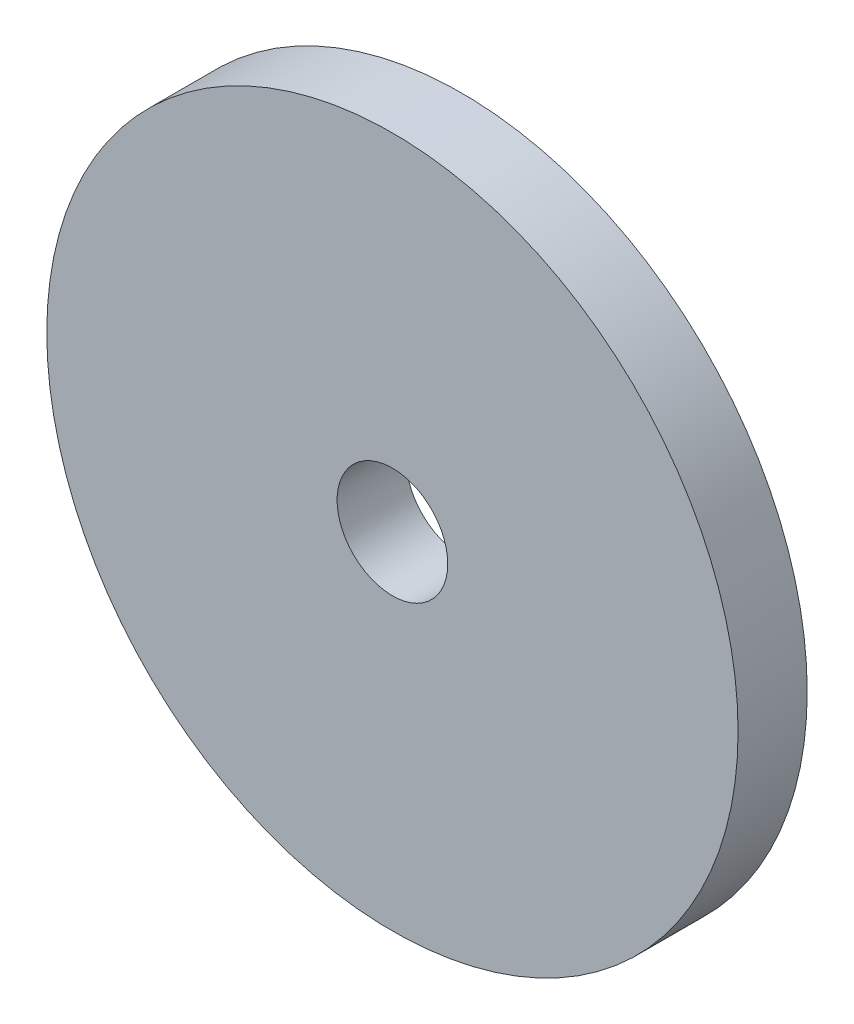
ISO-10303-21;
HEADER;
FILE_DESCRIPTION(('STEP AP214'),'2;1');
FILE_NAME('part.step','',(''),(''),'','','');
FILE_SCHEMA(('AUTOMOTIVE_DESIGN { 1 0 10303 214 1 1 1 1 }'));
ENDSEC;
DATA;
#1=APPLICATION_CONTEXT('core data for automotive mechanical design processes');
#2=APPLICATION_PROTOCOL_DEFINITION('international standard','automotive_design',2000,#1);
#3=PRODUCT_CONTEXT('',#1,'mechanical');
#4=PRODUCT('Part','Part','',(#3));
#5=PRODUCT_RELATED_PRODUCT_CATEGORY('part','',(#4));
#6=PRODUCT_DEFINITION_FORMATION('','',#4);
#7=PRODUCT_DEFINITION_CONTEXT('part definition',#1,'design');
#8=PRODUCT_DEFINITION('design','',#6,#7);
#9=PRODUCT_DEFINITION_SHAPE('','',#8);
#10=(LENGTH_UNIT() NAMED_UNIT(*) SI_UNIT(.MILLI.,.METRE.));
#11=(NAMED_UNIT(*) PLANE_ANGLE_UNIT() SI_UNIT($,.RADIAN.));
#12=(NAMED_UNIT(*) SI_UNIT($,.STERADIAN.) SOLID_ANGLE_UNIT());
#13=UNCERTAINTY_MEASURE_WITH_UNIT(LENGTH_MEASURE(1.E-05),#10,'distance_accuracy_value','');
#14=(GEOMETRIC_REPRESENTATION_CONTEXT(3) GLOBAL_UNCERTAINTY_ASSIGNED_CONTEXT((#13)) GLOBAL_UNIT_ASSIGNED_CONTEXT((#10,
#11,#12)) REPRESENTATION_CONTEXT('',''));
#15=CARTESIAN_POINT('',(0.,0.,0.));
#16=DIRECTION('',(0.,0.,1.));
#17=DIRECTION('',(1.,0.,0.));
#18=AXIS2_PLACEMENT_3D('',#15,#16,#17);
#19=CARTESIAN_POINT('',(0.,0.,5.));
#20=DIRECTION('',(0.,0.,1.));
#21=DIRECTION('',(1.,0.,0.));
#22=AXIS2_PLACEMENT_3D('',#19,#20,#21);
#23=PLANE('',#22);
#24=CARTESIAN_POINT('',(0.,0.,5.));
#25=DIRECTION('',(0.,0.,1.));
#26=DIRECTION('',(1.,0.,0.));
#27=AXIS2_PLACEMENT_3D('',#24,#25,#26);
#28=CIRCLE('',#27,25.);
#29=CARTESIAN_POINT('',(25.,0.,5.));
#30=VERTEX_POINT('',#29);
#31=EDGE_CURVE('E10',#30,#30,#28,.T.);
#32=ORIENTED_EDGE('',*,*,#31,.T.);
#33=EDGE_LOOP('',(#32));
#34=FACE_BOUND('',#33,.T.);
#35=CARTESIAN_POINT('',(0.,0.,5.));
#36=DIRECTION('',(0.,0.,1.));
#37=DIRECTION('',(1.,0.,0.));
#38=AXIS2_PLACEMENT_3D('',#35,#36,#37);
#39=CIRCLE('',#38,4.);
#40=CARTESIAN_POINT('',(4.,0.,5.));
#41=VERTEX_POINT('',#40);
#42=EDGE_CURVE('E45',#41,#41,#39,.T.);
#43=ORIENTED_EDGE('',*,*,#42,.F.);
#44=EDGE_LOOP('',(#43));
#45=FACE_BOUND('',#44,.T.);
#46=ADVANCED_FACE('F34',(#34,#45),#23,.T.);
#47=CARTESIAN_POINT('',(0.,0.,0.));
#48=DIRECTION('',(0.,0.,1.));
#49=DIRECTION('',(1.,0.,0.));
#50=AXIS2_PLACEMENT_3D('',#47,#48,#49);
#51=PLANE('',#50);
#52=CARTESIAN_POINT('',(0.,0.,0.));
#53=DIRECTION('',(0.,0.,1.));
#54=DIRECTION('',(1.,0.,0.));
#55=AXIS2_PLACEMENT_3D('',#52,#53,#54);
#56=CIRCLE('',#55,25.);
#57=CARTESIAN_POINT('',(25.,0.,0.));
#58=VERTEX_POINT('',#57);
#59=EDGE_CURVE('E38',#58,#58,#56,.T.);
#60=ORIENTED_EDGE('',*,*,#59,.F.);
#61=EDGE_LOOP('',(#60));
#62=FACE_BOUND('',#61,.T.);
#63=CARTESIAN_POINT('',(0.,0.,0.));
#64=DIRECTION('',(0.,0.,1.));
#65=DIRECTION('',(1.,0.,0.));
#66=AXIS2_PLACEMENT_3D('',#63,#64,#65);
#67=CIRCLE('',#66,4.);
#68=CARTESIAN_POINT('',(4.,0.,0.));
#69=VERTEX_POINT('',#68);
#70=EDGE_CURVE('E47',#69,#69,#67,.T.);
#71=ORIENTED_EDGE('',*,*,#70,.T.);
#72=EDGE_LOOP('',(#71));
#73=FACE_BOUND('',#72,.T.);
#74=ADVANCED_FACE('F57',(#62,#73),#51,.F.);
#75=CARTESIAN_POINT('',(0.,0.,5.));
#76=DIRECTION('',(0.,0.,-1.));
#77=DIRECTION('',(-1.,0.,0.));
#78=AXIS2_PLACEMENT_3D('',#75,#76,#77);
#79=CYLINDRICAL_SURFACE('',#78,25.);
#80=ORIENTED_EDGE('',*,*,#31,.F.);
#81=EDGE_LOOP('',(#80));
#82=FACE_BOUND('',#81,.T.);
#83=ORIENTED_EDGE('',*,*,#59,.T.);
#84=EDGE_LOOP('',(#83));
#85=FACE_BOUND('',#84,.T.);
#86=ADVANCED_FACE('F36',(#82,#85),#79,.T.);
#87=CARTESIAN_POINT('',(0.,0.,5.));
#88=DIRECTION('',(0.,0.,-1.));
#89=DIRECTION('',(-1.,0.,0.));
#90=AXIS2_PLACEMENT_3D('',#87,#88,#89);
#91=CYLINDRICAL_SURFACE('',#90,4.);
#92=ORIENTED_EDGE('',*,*,#42,.T.);
#93=EDGE_LOOP('',(#92));
#94=FACE_BOUND('',#93,.T.);
#95=ORIENTED_EDGE('',*,*,#70,.F.);
#96=EDGE_LOOP('',(#95));
#97=FACE_BOUND('',#96,.T.);
#98=ADVANCED_FACE('F53',(#94,#97),#91,.F.);
#99=CLOSED_SHELL('',(#46,#74,#86,#98));
#100=MANIFOLD_SOLID_BREP('B2',#99);
#101=ADVANCED_BREP_SHAPE_REPRESENTATION('',(#18,#100),#14);
#102=SHAPE_DEFINITION_REPRESENTATION(#9,#101);
ENDSEC;
END-ISO-10303-21;
